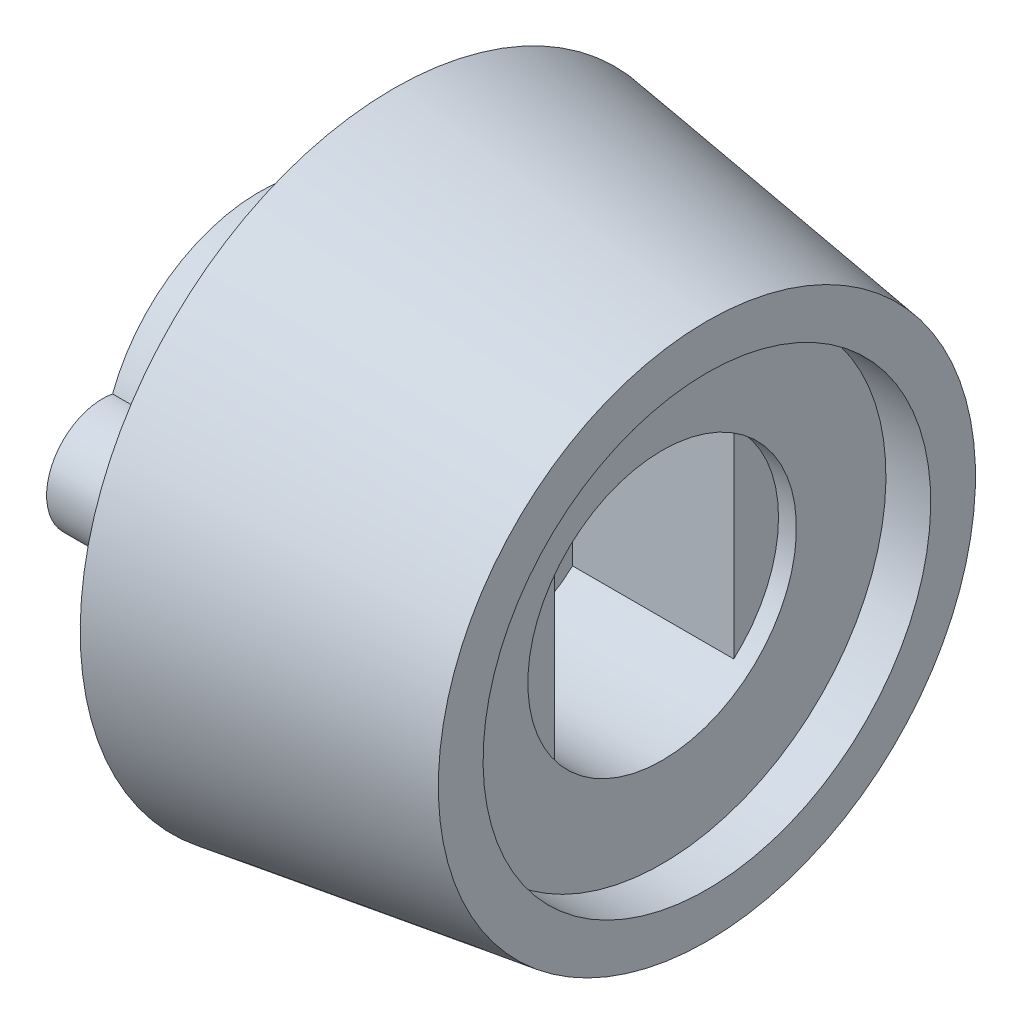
from build123d import *

# Parameters (mm, degrees)
ESQUISSE2_R             = 3.5
EXTRUSION1_DEPTH        = 3
ESQUISSE5_R             = 1.250283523
EXTRUSION2_DEPTH        = 3
ESQUISSE6_R             = 5
ENL_V_MAT_EXTRU_5_DEPTH = 1
ESQUISSE7_R             = 2
ENL_V_MAT_EXTRU_6_DEPTH = 15.071247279
ESQUISSE8_R             = 3
ENL_V_MAT_EXTRU_7_DEPTH = 4
EXTRUSION4_START        = 3.6
EXTRUSION4_DEPTH        = 3.6


with BuildPart() as part:
    # Esquisse1 → R_volution1 (revolve)
    with BuildSketch(Plane.XY):
        Polygon((-18.092835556, 0), (-18.092835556, 7), (-11.092835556, 6), (-11.092835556, 0), align=None)
    revolve(axis=Axis((-11.092835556, 0, 0), (-1, 0, 0)))

    # Esquisse2 → Extrusion1 (add)
    with BuildSketch(Plane.ZY.offset(18.092835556)):
        with Locations(Location((0, 0, 0), (0, 0, 270))):
            Circle(ESQUISSE2_R)
    extrude(amount=EXTRUSION1_DEPTH)

    # Esquisse5 → Extrusion2 (add)
    with BuildSketch(Plane.ZY.offset(18.092835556)):
        with Locations((3.5, 0)):
            Circle(ESQUISSE5_R)
    extrude(amount=EXTRUSION2_DEPTH)

    # Esquisse6 → Enl_v. mat.-Extru.5 (cut)
    with BuildSketch(Plane(origin=(-11.092835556, 0, 0), x_dir=(0, 0, -1), z_dir=(1, 0, 0))):
        with Locations(Location((0, 0, 0), (0, 0, 90))):
            Circle(ESQUISSE6_R)
    extrude(amount=-ENL_V_MAT_EXTRU_5_DEPTH, mode=Mode.SUBTRACT)

    # Esquisse7 → Enl_v. mat.-Extru.6 (cut, through all)
    with BuildSketch(Plane.ZY.offset(21.092835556)):
        with Locations(Location((0, 0, 0), (0, 0, 270))):
            Circle(ESQUISSE7_R)
    extrude(amount=-ENL_V_MAT_EXTRU_6_DEPTH, mode=Mode.SUBTRACT)

    # Esquisse8 → Enl_v. mat.-Extru.7 (cut)
    with BuildSketch(Plane(origin=(-12.092835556, 0, 0), x_dir=(0, 0, -1), z_dir=(1, 0, 0))):
        with Locations(Location((0, 0, 0), (0, 0, 90))):
            Circle(ESQUISSE8_R)
    extrude(amount=-ENL_V_MAT_EXTRU_7_DEPTH, mode=Mode.SUBTRACT)

    # Esquisse9 → Extrusion4 (add)
    with BuildSketch(Plane(origin=(-16.092835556, 0, 0), x_dir=(0, 0, -1), z_dir=(1, 0, 0)).offset(EXTRUSION4_START)):
        with BuildLine():
            Line((-2, -2.236067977), (-2, 2.236067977))
            ThreePointArc((-2, 2.236067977), (-3, 0), (-2, -2.236067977))
        make_face()
        with BuildLine():
            Line((2, 2.236067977), (2, -2.236067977))
            ThreePointArc((2, -2.236067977), (3, 0), (2, 2.236067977))
        make_face()
    extrude(amount=-EXTRUSION4_DEPTH)


solid = part.part
